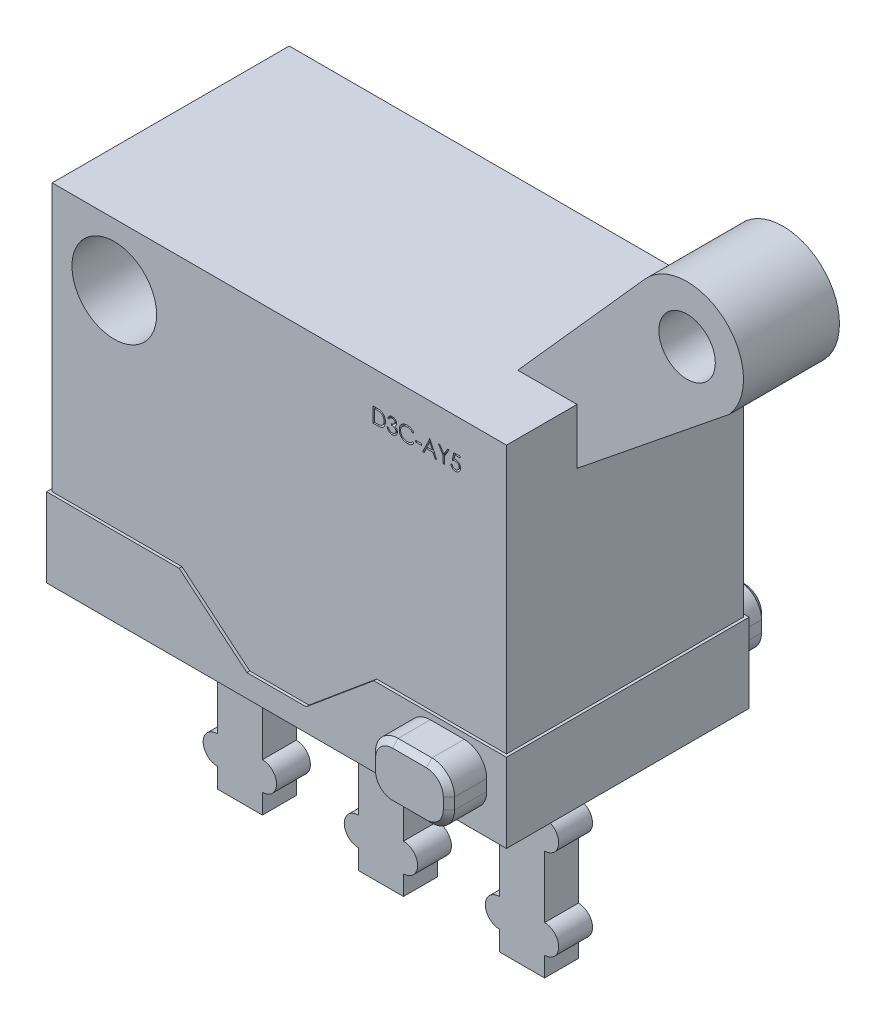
from build123d import *

# Parameters (mm, degrees)
EXTRUDE1_DEPTH      = 4.2
EXTRUDE2_DEPTH      = 0.05
EXTRUDE3_DEPTH      = 0.05
SKETCH5_W           = 4.3
SKETCH5_H           = 1.4
EXTRUDE4_DEPTH      = 0.05
SKETCH6_W           = 4.3
SKETCH6_H           = 1.4
EXTRUDE5_DEPTH      = 0.05
SKETCH10_W          = 1.3
SKETCH10_H          = 0.6
EXTRUDE7_DEPTH      = 3.5
CUT_EXTRUDE3_DEPTH  = 15.422291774
SKETCH12_W          = 0.10176282
SKETCH12_H          = 0.027136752
CUT_EXTRUDE4_DEPTH  = 0.1
SKETCH14_R          = 0.75
CUT_EXTRUDE5_DEPTH  = 15.834503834
CUT_EXTRUDE7_DEPTH  = 10
SKETCH16_R          = 0.5
CUT_EXTRUDE8_DEPTH  = 15.834503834
EXTRUDE8_DEPTH      = 0.67
EXTRUDE9_DEPTH      = 0.67
CHAMFER1_SIZE       = 0.1
CUT_EXTRUDE9_DEPTH  = 1.25
CUT_EXTRUDE10_DEPTH = 1.25


with BuildPart() as part:
    # Sketch1 → Extrude1 (new body)
    with BuildSketch(Plane.XY):
        with BuildLine():
            Line((7, 6.14), (9.253870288, 8.665800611))
            ThreePointArc((9.253870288, 8.665800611), (10.665800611, 8.746129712), (10.746129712, 7.334199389))
            Line((10.746129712, 7.334199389), (8.05, 5.158496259))
            Line((8.05, 5.158496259), (8.05, 0))
            Line((8.05, 0), (7.42, 0))
            Line((7.42, 0), (7.42, 0.35))
            Line((7.42, 0.35), (5.82, 0.35))
            Line((5.82, 0.35), (5.72, 0))
            Line((5.72, 0), (2.33, 0))
            Line((2.33, 0), (2.23, 0.35))
            Line((2.23, 0.35), (0.63, 0.35))
            Line((0.63, 0.35), (0.63, 0))
            Line((0.63, 0), (0, 0))
            Line((0, 0), (0, 6.14))
            Line((0, 6.14), (7, 6.14))
        make_face()
    extrude(amount=-EXTRUDE1_DEPTH)

    # Sketch2 → Extrude2 (add)
    with BuildSketch(Plane.XY):
        Polygon((0, 0), (0, 1.4), (2.3, 1.4), (3.5, 0.4), (4.55, 0.4), (5.75, 1.4), (8.05, 1.4), (8.05, 0), align=None)
    extrude(amount=EXTRUDE2_DEPTH)

    # Sketch3 → Extrude3 (add)
    with BuildSketch(Plane(origin=(0, 0, -4.2), x_dir=(-1, 0, 0), z_dir=(0, 0, -1))):
        Polygon((-8.05, 0), (0, 0), (0, 1.4), (-2.3, 1.4), (-3.5, 0.4), (-4.55, 0.4), (-5.75, 1.4), (-8.05, 1.4), align=None)
    extrude(amount=EXTRUDE3_DEPTH)

    # Sketch5 → Extrude4 (add)
    with BuildSketch(Plane.ZY):
        with Locations((-2.1, 0.7)):
            Rectangle(SKETCH5_W, SKETCH5_H)
    extrude(amount=EXTRUDE4_DEPTH)

    # Sketch6 → Extrude5 (add)
    with BuildSketch(Plane(origin=(8.05, 0, 0), x_dir=(0, 0, -1), z_dir=(1, 0, 0))):
        with Locations((2.1, 0.7)):
            Rectangle(SKETCH6_W, SKETCH6_H)
    extrude(amount=EXTRUDE5_DEPTH)

    # Sketch10 → Extrude7 (add)
    with BuildSketch(Plane.XZ):
        with Locations((1.525, -2.1)):
            Rectangle(SKETCH10_W, SKETCH10_H)
        with Locations((4.025, -2.1)):
            Rectangle(SKETCH10_W, SKETCH10_H)
        with Locations((6.525, -2.1)):
            Rectangle(SKETCH10_W, SKETCH10_H)
    extrude(amount=EXTRUDE7_DEPTH)


with BuildPart() as extrude7_piece_1:
    # of the separate pieces the step leaves, piece 1, a body of its own (extrude7_pieces)
    add(part.part.solids().sort_by_distance((7, 6.14, 0))[0])

    # Sketch11 → Cut-Extrude3 (cut, through all)
    with BuildSketch(Plane.XY.offset(-1.8)):
        with BuildLine():
            Line((1.125, 0), (0.875, 0))
            Line((0.875, 0), (0.875, -1.3))
            ThreePointArc((0.875, -1.3), (0.948223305, -1.123223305), (1.125, -1.05))
            Line((1.125, -1.05), (1.125, 0))
        make_face()
        with BuildLine():
            ThreePointArc((1.125, -1.55), (0.948223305, -1.476776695), (0.875, -1.3))
            Line((0.875, -1.3), (0.875, -2.9))
            ThreePointArc((0.875, -2.9), (0.948223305, -2.723223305), (1.125, -2.65))
            Line((1.125, -2.65), (1.125, -1.55))
        make_face()
        with BuildLine():
            ThreePointArc((1.125, -3.15), (0.948223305, -3.076776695), (0.875, -2.9))
            Line((0.875, -2.9), (0.875, -3.5))
            Line((0.875, -3.5), (1.125, -3.5))
            Line((1.125, -3.5), (1.125, -3.15))
        make_face()
        with BuildLine():
            Line((2.175, 0), (1.925, 0))
            Line((1.925, 0), (1.925, -1.05))
            ThreePointArc((1.925, -1.05), (2.101776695, -1.123223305), (2.175, -1.3))
            Line((2.175, -1.3), (2.175, 0))
        make_face()
        with BuildLine():
            Line((2.175, -2.9), (2.175, -1.3))
            ThreePointArc((2.175, -1.3), (2.101776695, -1.476776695), (1.925, -1.55))
            Line((1.925, -1.55), (1.925, -2.65))
            ThreePointArc((1.925, -2.65), (2.101776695, -2.723223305), (2.175, -2.9))
        make_face()
        with BuildLine():
            Line((2.175, -3.5), (2.175, -2.9))
            ThreePointArc((2.175, -2.9), (2.101776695, -3.076776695), (1.925, -3.15))
            Line((1.925, -3.15), (1.925, -3.5))
            Line((1.925, -3.5), (2.175, -3.5))
        make_face()
        with BuildLine():
            Line((3.625, -1.05), (3.625, 0))
            Line((3.625, 0), (3.375, 0))
            Line((3.375, 0), (3.375, -1.3))
            ThreePointArc((3.375, -1.3), (3.448223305, -1.123223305), (3.625, -1.05))
        make_face()
        with BuildLine():
            ThreePointArc((3.625, -1.55), (3.448223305, -1.476776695), (3.375, -1.3))
            Line((3.375, -1.3), (3.375, -2.9))
            ThreePointArc((3.375, -2.9), (3.448223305, -2.723223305), (3.625, -2.65))
            Line((3.625, -2.65), (3.625, -1.55))
        make_face()
        with BuildLine():
            ThreePointArc((3.625, -3.15), (3.448223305, -3.076776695), (3.375, -2.9))
            Line((3.375, -2.9), (3.375, -3.5))
            Line((3.375, -3.5), (3.625, -3.5))
            Line((3.625, -3.5), (3.625, -3.15))
        make_face()
        with BuildLine():
            Line((4.675, 0), (4.425, 0))
            Line((4.425, 0), (4.425, -1.05))
            ThreePointArc((4.425, -1.05), (4.601776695, -1.123223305), (4.675, -1.3))
            Line((4.675, -1.3), (4.675, 0))
        make_face()
        with BuildLine():
            Line((4.675, -2.9), (4.675, -1.3))
            ThreePointArc((4.675, -1.3), (4.601776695, -1.476776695), (4.425, -1.55))
            Line((4.425, -1.55), (4.425, -2.65))
            ThreePointArc((4.425, -2.65), (4.601776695, -2.723223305), (4.675, -2.9))
        make_face()
        with BuildLine():
            Line((4.675, -3.5), (4.675, -2.9))
            ThreePointArc((4.675, -2.9), (4.601776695, -3.076776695), (4.425, -3.15))
            Line((4.425, -3.15), (4.425, -3.5))
            Line((4.425, -3.5), (4.675, -3.5))
        make_face()
        with BuildLine():
            Line((6.125, 0), (5.875, 0))
            Line((5.875, 0), (5.875, -1.3))
            ThreePointArc((5.875, -1.3), (5.948223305, -1.123223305), (6.125, -1.05))
            Line((6.125, -1.05), (6.125, 0))
        make_face()
        with BuildLine():
            ThreePointArc((6.125, -1.55), (5.948223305, -1.476776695), (5.875, -1.3))
            Line((5.875, -1.3), (5.875, -2.9))
            ThreePointArc((5.875, -2.9), (5.948223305, -2.723223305), (6.125, -2.65))
            Line((6.125, -2.65), (6.125, -1.55))
        make_face()
        with BuildLine():
            ThreePointArc((6.125, -3.15), (5.948223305, -3.076776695), (5.875, -2.9))
            Line((5.875, -2.9), (5.875, -3.5))
            Line((5.875, -3.5), (6.125, -3.5))
            Line((6.125, -3.5), (6.125, -3.15))
        make_face()
        with BuildLine():
            Line((7.175, 0), (6.925, 0))
            Line((6.925, 0), (6.925, -1.05))
            ThreePointArc((6.925, -1.05), (7.101776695, -1.123223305), (7.175, -1.3))
            Line((7.175, -1.3), (7.175, 0))
        make_face()
        with BuildLine():
            Line((7.175, -2.9), (7.175, -1.3))
            ThreePointArc((7.175, -1.3), (7.101776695, -1.476776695), (6.925, -1.55))
            Line((6.925, -1.55), (6.925, -2.65))
            ThreePointArc((6.925, -2.65), (7.101776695, -2.723223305), (7.175, -2.9))
        make_face()
        with BuildLine():
            Line((7.175, -3.5), (7.175, -2.9))
            ThreePointArc((7.175, -2.9), (7.101776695, -3.076776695), (6.925, -3.15))
            Line((6.925, -3.15), (6.925, -3.5))
            Line((6.925, -3.5), (7.175, -3.5))
        make_face()
    extrude(amount=-CUT_EXTRUDE3_DEPTH, mode=Mode.SUBTRACT)

    # Sketch12 → Cut-Extrude4 (cut)
    # profile 1 of 7: a face of its own
    with BuildSketch(Plane(origin=(5.211363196, -0.193911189, 0), x_dir=(1, 0, 0), z_dir=(0, 0, 1))):
        with BuildLine():
            Line((0.477164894, 5.488345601), (0.477164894, 5.752928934))
            Line((0.477164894, 5.752928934), (0.530590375, 5.752928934))
            add(Edge.make_bspline(
                [(0.530590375, 5.752928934), (0.535237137, 5.752895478), (0.544214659, 5.752830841), (0.557187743, 5.75242101), (0.569191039, 5.751696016), (0.580185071, 5.750639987), (0.59020002, 5.749343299), (0.599207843, 5.747717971), (0.607255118, 5.745798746), (0.612204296, 5.744162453), (0.614544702, 5.74338867)],
                knots=[0, 0, 0, 0, 1.314313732, 2.53924729, 3.670748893, 4.714932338, 5.66265055, 6.526160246, 7.303039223, 8, 8, 8, 8], degree=3))
            add(Edge.make_bspline(
                [(0.614544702, 5.74338867), (0.617605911, 5.742222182), (0.623658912, 5.739915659), (0.632277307, 5.735564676), (0.640390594, 5.730634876), (0.648042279, 5.72511976), (0.65505758, 5.71886317), (0.661710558, 5.712130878), (0.667729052, 5.704678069), (0.673240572, 5.696659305), (0.678209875, 5.688169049), (0.682529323, 5.679223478), (0.686116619, 5.669868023), (0.689094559, 5.660128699), (0.691441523, 5.649984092), (0.693042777, 5.639422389), (0.694098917, 5.628485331), (0.694205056, 5.621063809), (0.694258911, 5.617298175)],
                knots=[0, 0, 0, 0, 0.984719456, 1.947108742, 2.898477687, 3.838006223, 4.779231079, 5.722358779, 6.681677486, 7.655904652, 8.64651281, 9.637519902, 10.640069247, 11.656948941, 12.698408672, 13.768548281, 14.867775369, 16, 16, 16, 16], degree=3))
            add(Edge.make_bspline(
                [(0.694258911, 5.617298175), (0.694211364, 5.614027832), (0.694117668, 5.607583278), (0.693276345, 5.598085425), (0.692053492, 5.588869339), (0.69016027, 5.579978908), (0.687861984, 5.571336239), (0.68491648, 5.563033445), (0.681542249, 5.554994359), (0.677607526, 5.547327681), (0.67328791, 5.540064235), (0.668652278, 5.533217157), (0.663705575, 5.526884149), (0.658400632, 5.521046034), (0.652806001, 5.515711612), (0.646885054, 5.510836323), (0.640622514, 5.506515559), (0.63404643, 5.502579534), (0.62696496, 5.499145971), (0.619243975, 5.496240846), (0.610850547, 5.493833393), (0.601805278, 5.49182476), (0.592092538, 5.490231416), (0.581702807, 5.489163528), (0.570652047, 5.488441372), (0.563063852, 5.488378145), (0.559158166, 5.488345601)],
                knots=[0, 0, 0, 0, 1.105936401, 2.179363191, 3.223086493, 4.248585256, 5.251745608, 6.245858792, 7.225916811, 8.198733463, 9.158002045, 10.082870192, 10.993790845, 11.873723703, 12.748670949, 13.606408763, 14.465103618, 15.319838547, 16.196477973, 17.123216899, 18.106603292, 19.147568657, 20.255746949, 21.433717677, 22.679120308, 24, 24, 24, 24], degree=3))
            Line((0.559158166, 5.488345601), (0.477164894, 5.488345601))
        make_face()
        with BuildLine():
            Line((0.500909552, 5.515482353), (0.531279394, 5.515482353))
            add(Edge.make_bspline(
                [(0.531279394, 5.515482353), (0.535643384, 5.515501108), (0.544036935, 5.515537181), (0.556106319, 5.515853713), (0.567134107, 5.516370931), (0.577121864, 5.517094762), (0.58606395, 5.518052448), (0.593979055, 5.519120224), (0.600841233, 5.520450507), (0.604993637, 5.521656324), (0.60691249, 5.52221354)],
                knots=[0, 0, 0, 0, 1.375205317, 2.645023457, 3.804390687, 4.853969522, 5.800190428, 6.637939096, 7.370582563, 8, 8, 8, 8], degree=3))
            add(Edge.make_bspline(
                [(0.60691249, 5.52221354), (0.609327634, 5.523064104), (0.614100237, 5.524744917), (0.620970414, 5.527810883), (0.62737764, 5.531442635), (0.633433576, 5.535479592), (0.639052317, 5.540064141), (0.64430045, 5.545096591), (0.649167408, 5.550602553), (0.653602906, 5.556575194), (0.657572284, 5.562977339), (0.661009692, 5.569746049), (0.664022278, 5.576807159), (0.666386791, 5.584269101), (0.668240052, 5.592065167), (0.66955274, 5.600195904), (0.670370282, 5.608659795), (0.670465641, 5.614416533), (0.670514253, 5.617351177)],
                knots=[0, 0, 0, 0, 0.998632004, 1.973411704, 2.929992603, 3.868527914, 4.809262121, 5.754881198, 6.702106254, 7.672490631, 8.653608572, 9.636854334, 10.631411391, 11.644891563, 12.686317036, 13.754757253, 14.855430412, 16, 16, 16, 16], degree=3))
            add(Edge.make_bspline(
                [(0.670514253, 5.617351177), (0.670475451, 5.620445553), (0.670399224, 5.626524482), (0.669441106, 5.635444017), (0.668040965, 5.644022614), (0.666016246, 5.652260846), (0.663436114, 5.660174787), (0.660216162, 5.667720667), (0.656537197, 5.674978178), (0.652159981, 5.681779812), (0.647366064, 5.688212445), (0.642045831, 5.694105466), (0.636283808, 5.699472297), (0.63014284, 5.704396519), (0.623449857, 5.708680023), (0.616362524, 5.712511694), (0.60877687, 5.715763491), (0.603499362, 5.717493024), (0.600817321, 5.718371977)],
                knots=[0, 0, 0, 0, 1.122418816, 2.205001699, 3.251619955, 4.274784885, 5.280384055, 6.268708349, 7.249350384, 8.229342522, 9.199999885, 10.157847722, 11.105861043, 12.055065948, 13.010012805, 13.98527497, 14.976112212, 16, 16, 16, 16], degree=3))
            add(Edge.make_bspline(
                [(0.600817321, 5.718371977), (0.598598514, 5.71898554), (0.593880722, 5.720290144), (0.586182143, 5.721713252), (0.577517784, 5.722968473), (0.567849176, 5.724031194), (0.55718734, 5.724793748), (0.545524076, 5.725366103), (0.532854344, 5.72575214), (0.524071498, 5.725778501), (0.519513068, 5.725792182)],
                knots=[0, 0, 0, 0, 0.674548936, 1.434276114, 2.292660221, 3.240891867, 4.284742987, 5.42552168, 6.663806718, 8, 8, 8, 8], degree=3))
            Line((0.519513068, 5.725792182), (0.500909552, 5.725792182))
            Line((0.500909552, 5.725792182), (0.500909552, 5.515482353))
        make_face(mode=Mode.SUBTRACT)
    # profile 2 of 7: a face of its own
    with BuildSketch(Plane(origin=(5.211363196, -0.193911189, 0), x_dir=(1, 0, 0), z_dir=(0, 0, 1))):
        with BuildLine():
            Line((0.758708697, 5.691871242), (0.734964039, 5.691871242))
            add(Edge.make_bspline(
                [(0.734964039, 5.691871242), (0.735607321, 5.69453465), (0.736864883, 5.699741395), (0.739487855, 5.707180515), (0.742345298, 5.71422021), (0.745776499, 5.720728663), (0.749519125, 5.726836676), (0.753807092, 5.732405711), (0.758442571, 5.737577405), (0.763569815, 5.742167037), (0.768946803, 5.746323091), (0.774649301, 5.749866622), (0.780562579, 5.752914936), (0.786727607, 5.755426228), (0.793162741, 5.757318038), (0.799809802, 5.758690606), (0.806686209, 5.759581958), (0.811354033, 5.75966895), (0.813724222, 5.759713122)],
                knots=[0, 0, 0, 0, 1.162005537, 2.271625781, 3.343758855, 4.383309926, 5.390229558, 6.379919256, 7.361854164, 8.333198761, 9.295911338, 10.242430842, 11.177959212, 12.116337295, 13.062827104, 14.020064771, 14.994644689, 16, 16, 16, 16], degree=3))
            add(Edge.make_bspline(
                [(0.813724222, 5.759713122), (0.81717762, 5.759608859), (0.824009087, 5.759402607), (0.834045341, 5.757519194), (0.843723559, 5.754538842), (0.852937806, 5.750420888), (0.86149658, 5.745341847), (0.869111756, 5.739296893), (0.875680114, 5.73240266), (0.881190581, 5.724787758), (0.88550518, 5.716649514), (0.888686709, 5.70827355), (0.890623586, 5.699679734), (0.890874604, 5.69387725), (0.891000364, 5.690970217)],
                knots=[0, 0, 0, 0, 1.083050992, 2.142477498, 3.193116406, 4.255571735, 5.30263384, 6.308962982, 7.297363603, 8.282367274, 9.249857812, 10.179914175, 11.08814088, 12, 12, 12, 12], degree=3))
            add(Edge.make_bspline(
                [(0.891000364, 5.690970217), (0.890912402, 5.68817268), (0.890740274, 5.682698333), (0.889278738, 5.674706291), (0.886819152, 5.667173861), (0.883412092, 5.660069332), (0.879001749, 5.653437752), (0.873659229, 5.6472642), (0.867346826, 5.641521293), (0.862563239, 5.638231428), (0.860100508, 5.636537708)],
                knots=[0, 0, 0, 0, 1.024540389, 2.004866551, 2.965041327, 3.920577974, 4.882998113, 5.874504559, 6.905732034, 8, 8, 8, 8], degree=3))
            add(Edge.make_bspline(
                [(0.860100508, 5.636537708), (0.862915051, 5.635178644), (0.868491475, 5.632485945), (0.876092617, 5.627205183), (0.882992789, 5.621107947), (0.886840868, 5.616349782), (0.888774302, 5.613959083)],
                knots=[0, 0, 0, 0, 1.015518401, 2.012035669, 3.001164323, 4, 4, 4, 4], degree=3))
            add(Edge.make_bspline(
                [(0.888774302, 5.613959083), (0.890047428, 5.612216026), (0.89257283, 5.608758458), (0.89569004, 5.603199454), (0.898517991, 5.597578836), (0.900721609, 5.591745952), (0.902428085, 5.585768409), (0.903647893, 5.579635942), (0.90440567, 5.573343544), (0.904514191, 5.569086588), (0.90456874, 5.56694678)],
                knots=[0, 0, 0, 0, 1.025084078, 2.033381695, 3.024893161, 4.013698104, 4.991890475, 5.976764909, 6.982997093, 8, 8, 8, 8], degree=3))
            add(Edge.make_bspline(
                [(0.90456874, 5.56694678), (0.904433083, 5.563241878), (0.904162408, 5.55584951), (0.901743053, 5.544927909), (0.897992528, 5.534251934), (0.892666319, 5.524040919), (0.886175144, 5.514487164), (0.878452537, 5.505939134), (0.869586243, 5.498591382), (0.859697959, 5.492452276), (0.848984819, 5.48754479), (0.837526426, 5.484138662), (0.82548788, 5.481920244), (0.817232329, 5.481682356), (0.813035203, 5.481561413)],
                knots=[0, 0, 0, 0, 0.955779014, 1.907060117, 2.875433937, 3.871313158, 4.872415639, 5.851225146, 6.836215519, 7.83643374, 8.849228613, 9.86973379, 10.916971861, 12, 12, 12, 12], degree=3))
            add(Edge.make_bspline(
                [(0.813035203, 5.481561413), (0.810206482, 5.481627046), (0.804640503, 5.481756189), (0.79645781, 5.482639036), (0.788647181, 5.484251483), (0.781198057, 5.486421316), (0.774103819, 5.489172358), (0.767386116, 5.492598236), (0.761003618, 5.496628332), (0.755016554, 5.501310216), (0.749425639, 5.506547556), (0.744379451, 5.512433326), (0.739793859, 5.518858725), (0.735791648, 5.525898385), (0.732190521, 5.53346133), (0.729228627, 5.541644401), (0.726621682, 5.550374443), (0.725409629, 5.556458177), (0.724787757, 5.559579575)],
                knots=[0, 0, 0, 0, 1.048658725, 2.063410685, 3.046034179, 4.001477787, 4.936774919, 5.862367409, 6.792675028, 7.730719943, 8.675894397, 9.627829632, 10.600096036, 11.597688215, 12.626045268, 13.701542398, 14.82072376, 16, 16, 16, 16], degree=3))
            Line((0.724787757, 5.559579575), (0.748532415, 5.559579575))
            add(Edge.make_bspline(
                [(0.748532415, 5.559579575), (0.749151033, 5.557542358), (0.750354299, 5.553579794), (0.752402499, 5.547876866), (0.754735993, 5.542648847), (0.757239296, 5.537857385), (0.759868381, 5.533455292), (0.762810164, 5.529558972), (0.76584676, 5.525997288), (0.768135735, 5.523990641), (0.76925599, 5.523008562)],
                knots=[0, 0, 0, 0, 1.198163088, 2.33053128, 3.407730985, 4.417276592, 5.372219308, 6.28897303, 7.162600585, 8, 8, 8, 8], degree=3))
            add(Edge.make_bspline(
                [(0.76925599, 5.523008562), (0.770737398, 5.521866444), (0.77369564, 5.519585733), (0.778516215, 5.516675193), (0.783586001, 5.514153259), (0.789014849, 5.512226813), (0.794685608, 5.510595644), (0.800689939, 5.5095282), (0.806974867, 5.508795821), (0.81126624, 5.508731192), (0.813459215, 5.508698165)],
                knots=[0, 0, 0, 0, 0.946170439, 1.889420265, 2.845303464, 3.807233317, 4.801018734, 5.828864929, 6.890507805, 8, 8, 8, 8], degree=3))
            add(Edge.make_bspline(
                [(0.813459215, 5.508698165), (0.815935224, 5.508744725), (0.820776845, 5.508835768), (0.827841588, 5.509673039), (0.834562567, 5.510892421), (0.840865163, 5.512775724), (0.846831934, 5.51510261), (0.852379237, 5.518024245), (0.857579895, 5.52145209), (0.862367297, 5.525348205), (0.866672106, 5.529613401), (0.870462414, 5.534074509), (0.873684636, 5.538712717), (0.87628387, 5.543553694), (0.878336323, 5.548577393), (0.879733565, 5.553797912), (0.880705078, 5.559172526), (0.880784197, 5.562825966), (0.880824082, 5.564667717)],
                knots=[0, 0, 0, 0, 1.217147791, 2.380027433, 3.494444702, 4.572153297, 5.609568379, 6.639424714, 7.649109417, 8.668170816, 9.669597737, 10.625200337, 11.543417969, 12.441394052, 13.322311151, 14.205496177, 15.095365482, 16, 16, 16, 16], degree=3))
            add(Edge.make_bspline(
                [(0.880824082, 5.564667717), (0.880708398, 5.567132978), (0.880477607, 5.572051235), (0.878715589, 5.579287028), (0.875817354, 5.586258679), (0.871759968, 5.592847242), (0.866820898, 5.598953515), (0.861048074, 5.604401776), (0.854393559, 5.608897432), (0.848268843, 5.612003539), (0.842843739, 5.614123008), (0.838201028, 5.615534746), (0.833003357, 5.616730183), (0.827313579, 5.617842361), (0.821088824, 5.618788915), (0.814335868, 5.619578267), (0.807053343, 5.620209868), (0.802011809, 5.620491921), (0.799413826, 5.620637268)],
                knots=[0, 0, 0, 0, 1.07054697, 2.135767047, 3.216561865, 4.33974944, 5.486079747, 6.621378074, 7.775625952, 8.963672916, 9.598146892, 10.304877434, 11.070270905, 11.915000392, 12.823868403, 13.805723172, 14.86925407, 16, 16, 16, 16], degree=3))
            Line((0.799413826, 5.620637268), (0.799413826, 5.64777402))
            add(Edge.make_bspline(
                [(0.799413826, 5.64777402), (0.802687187, 5.647829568), (0.809098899, 5.647938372), (0.818464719, 5.649254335), (0.827420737, 5.651074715), (0.835768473, 5.65386306), (0.843377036, 5.657101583), (0.849977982, 5.660870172), (0.855478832, 5.665059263), (0.859852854, 5.669733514), (0.863143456, 5.674746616), (0.865549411, 5.679971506), (0.866970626, 5.68545398), (0.867160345, 5.689195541), (0.867255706, 5.69107622)],
                knots=[0, 0, 0, 0, 1.321986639, 2.589447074, 3.816329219, 5.01088745, 6.139805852, 7.153945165, 8.075214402, 8.924034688, 9.728124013, 10.488707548, 11.240355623, 12, 12, 12, 12], degree=3))
            add(Edge.make_bspline(
                [(0.867255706, 5.69107622), (0.867224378, 5.692457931), (0.867162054, 5.695206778), (0.866376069, 5.69922278), (0.865194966, 5.703116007), (0.863571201, 5.706869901), (0.861397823, 5.710458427), (0.858796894, 5.713912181), (0.855699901, 5.717211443), (0.852151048, 5.720286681), (0.848340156, 5.723217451), (0.844163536, 5.725705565), (0.839747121, 5.727833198), (0.83508602, 5.729587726), (0.830165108, 5.730907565), (0.825007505, 5.731855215), (0.819603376, 5.732447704), (0.815916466, 5.732533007), (0.814042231, 5.73257637)],
                knots=[0, 0, 0, 0, 0.884392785, 1.759457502, 2.611959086, 3.489218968, 4.37281399, 5.2945488, 6.255912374, 7.266815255, 8.301784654, 9.332968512, 10.37626691, 11.440494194, 12.520033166, 13.637162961, 14.798855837, 16, 16, 16, 16], degree=3))
            add(Edge.make_bspline(
                [(0.814042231, 5.73257637), (0.811029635, 5.73247119), (0.805145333, 5.732265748), (0.79666242, 5.730466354), (0.788776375, 5.727595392), (0.782748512, 5.724168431), (0.778297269, 5.720785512), (0.775116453, 5.717831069), (0.771992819, 5.714547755), (0.769131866, 5.710733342), (0.766238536, 5.70664615), (0.763604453, 5.702078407), (0.761044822, 5.697149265), (0.759502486, 5.693664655), (0.758708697, 5.691871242)],
                knots=[0, 0, 0, 0, 1.472543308, 2.876219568, 4.221790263, 5.565193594, 6.249813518, 6.953379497, 7.687249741, 8.463570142, 9.283606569, 10.136032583, 11.040678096, 12, 12, 12, 12], degree=3))
        make_face()
    # profile 3 of 7: a face of its own
    with BuildSketch(Plane(origin=(5.211363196, -0.193911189, 0), x_dir=(1, 0, 0), z_dir=(0, 0, 1))):
        with BuildLine():
            Line((1.196288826, 5.704379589), (1.17551225, 5.688479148))
            add(Edge.make_bspline(
                [(1.17551225, 5.688479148), (1.174030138, 5.690245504), (1.171085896, 5.693754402), (1.166349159, 5.698681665), (1.161412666, 5.703297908), (1.156278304, 5.707625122), (1.150853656, 5.711511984), (1.145270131, 5.71516105), (1.139434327, 5.718431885), (1.131364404, 5.722397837), (1.120807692, 5.726536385), (1.107518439, 5.730006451), (1.093645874, 5.732215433), (1.084181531, 5.73245468), (1.079367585, 5.73257637)],
                knots=[0, 0, 0, 0, 0.757959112, 1.505699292, 2.245454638, 2.979532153, 3.711538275, 4.438200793, 5.171680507, 5.909471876, 7.393775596, 8.890124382, 10.418191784, 12, 12, 12, 12], degree=3))
            add(Edge.make_bspline(
                [(1.079367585, 5.73257637), (1.076715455, 5.732545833), (1.071435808, 5.732485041), (1.063600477, 5.731683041), (1.055911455, 5.730555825), (1.048373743, 5.728883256), (1.040996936, 5.726768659), (1.033732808, 5.724241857), (1.02668653, 5.721115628), (1.019760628, 5.717660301), (1.013124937, 5.713757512), (1.006846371, 5.709500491), (1.000947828, 5.704936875), (0.995424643, 5.700049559), (0.990271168, 5.694860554), (0.985524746, 5.689314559), (0.981201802, 5.683429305), (0.977216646, 5.677282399), (0.973647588, 5.670891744), (0.970659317, 5.664233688), (0.968013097, 5.657422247), (0.965919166, 5.650380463), (0.964261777, 5.643157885), (0.963118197, 5.635735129), (0.962325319, 5.628127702), (0.962264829, 5.622971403), (0.962234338, 5.62037226)],
                knots=[0, 0, 0, 0, 1.054917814, 2.100044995, 3.131103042, 4.146048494, 5.169673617, 6.183595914, 7.203665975, 8.234915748, 9.262203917, 10.264457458, 11.251630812, 12.227803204, 13.197192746, 14.159520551, 15.12972552, 16.100847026, 17.073214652, 18.039054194, 19.002613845, 19.979014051, 20.95965708, 21.949030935, 22.966165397, 24, 24, 24, 24], degree=3))
            add(Edge.make_bspline(
                [(0.962234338, 5.62037226), (0.962329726, 5.616461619), (0.962517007, 5.608783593), (0.964183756, 5.597537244), (0.966716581, 5.586763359), (0.970512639, 5.576529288), (0.975193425, 5.566708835), (0.981108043, 5.557468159), (0.987958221, 5.548667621), (0.995840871, 5.540515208), (1.004489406, 5.53306804), (1.013768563, 5.526510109), (1.023655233, 5.521043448), (1.034040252, 5.516494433), (1.045003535, 5.512997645), (1.056525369, 5.510535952), (1.068580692, 5.508930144), (1.07681826, 5.508776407), (1.08101063, 5.508698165)],
                knots=[0, 0, 0, 0, 1.029171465, 2.020641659, 2.987623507, 3.938342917, 4.889210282, 5.84687017, 6.821220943, 7.821438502, 8.827599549, 9.822697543, 10.807740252, 11.797342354, 12.80366471, 13.83203677, 14.896651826, 16, 16, 16, 16], degree=3))
            add(Edge.make_bspline(
                [(1.08101063, 5.508698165), (1.085629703, 5.508825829), (1.094721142, 5.509077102), (1.108053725, 5.511205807), (1.120816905, 5.514657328), (1.133011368, 5.519487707), (1.144602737, 5.525767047), (1.155609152, 5.533379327), (1.166039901, 5.542396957), (1.172312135, 5.549282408), (1.17551225, 5.552795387)],
                knots=[0, 0, 0, 0, 1.028121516, 2.023589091, 2.998037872, 3.967518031, 4.937445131, 5.927275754, 6.942489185, 8, 8, 8, 8], degree=3))
            Line((1.17551225, 5.552795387), (1.196288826, 5.537053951))
            add(Edge.make_bspline(
                [(1.196288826, 5.537053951), (1.194616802, 5.53489658), (1.191280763, 5.530592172), (1.185878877, 5.524524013), (1.180188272, 5.518816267), (1.17416668, 5.513514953), (1.16788337, 5.50851399), (1.161225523, 5.503955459), (1.154280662, 5.499775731), (1.147072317, 5.495948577), (1.139608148, 5.492553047), (1.131897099, 5.489646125), (1.123972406, 5.487142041), (1.115833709, 5.485081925), (1.107464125, 5.483473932), (1.098893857, 5.482398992), (1.090104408, 5.48166255), (1.08417461, 5.481595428), (1.081169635, 5.481561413)],
                knots=[0, 0, 0, 0, 0.986787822, 1.968848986, 2.935600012, 3.899624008, 4.868462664, 5.837806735, 6.815139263, 7.798259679, 8.787526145, 9.778297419, 10.776456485, 11.791383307, 12.812564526, 13.85620153, 14.913611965, 16, 16, 16, 16], degree=3))
            add(Edge.make_bspline(
                [(1.081169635, 5.481561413), (1.078323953, 5.481581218), (1.072696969, 5.481620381), (1.064389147, 5.482254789), (1.056301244, 5.483120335), (1.048456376, 5.484423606), (1.040811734, 5.485961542), (1.033436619, 5.488023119), (1.026258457, 5.49033249), (1.019306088, 5.493046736), (1.012573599, 5.496109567), (1.006082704, 5.499571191), (0.999836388, 5.503402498), (0.99377324, 5.507519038), (0.987982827, 5.512053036), (0.982414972, 5.516941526), (0.977038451, 5.52216803), (0.973712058, 5.52593682), (0.97203961, 5.527831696)],
                knots=[0, 0, 0, 0, 1.114604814, 2.203992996, 3.262667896, 4.300477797, 5.318619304, 6.316056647, 7.298880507, 8.271930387, 9.238335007, 10.195173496, 11.151986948, 12.108099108, 13.064862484, 14.031167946, 15.010108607, 16, 16, 16, 16], degree=3))
            add(Edge.make_bspline(
                [(0.97203961, 5.527831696), (0.969360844, 5.531123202), (0.964035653, 5.537666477), (0.95722258, 5.548271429), (0.951390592, 5.559343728), (0.94667527, 5.570941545), (0.942989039, 5.583038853), (0.940435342, 5.595641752), (0.938775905, 5.608738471), (0.938586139, 5.617646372), (0.93848968, 5.62217431)],
                knots=[0, 0, 0, 0, 0.994628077, 1.977248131, 2.950237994, 3.925870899, 4.908910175, 5.911660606, 6.938484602, 8, 8, 8, 8], degree=3))
            add(Edge.make_bspline(
                [(0.93848968, 5.62217431), (0.938607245, 5.626933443), (0.938838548, 5.636296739), (0.940803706, 5.650037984), (0.943965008, 5.663203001), (0.94845513, 5.675767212), (0.954147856, 5.687796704), (0.961180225, 5.699199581), (0.969470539, 5.710048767), (0.978953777, 5.720179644), (0.989353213, 5.729443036), (1.000489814, 5.737592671), (1.012341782, 5.744374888), (1.024778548, 5.750044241), (1.03789324, 5.754401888), (1.051657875, 5.757452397), (1.066046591, 5.759351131), (1.075863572, 5.759591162), (1.080851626, 5.759713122)],
                knots=[0, 0, 0, 0, 1.032925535, 2.032216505, 3.007276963, 3.968222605, 4.92396291, 5.891752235, 6.871517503, 7.883894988, 8.900124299, 9.891468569, 10.874487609, 11.85992873, 12.854644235, 13.869047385, 14.917252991, 16, 16, 16, 16], degree=3))
            add(Edge.make_bspline(
                [(1.080851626, 5.759713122), (1.083891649, 5.759676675), (1.089909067, 5.759604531), (1.098810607, 5.758901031), (1.107477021, 5.757728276), (1.11591428, 5.756132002), (1.12416343, 5.754150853), (1.132161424, 5.751570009), (1.139955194, 5.748619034), (1.147495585, 5.745220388), (1.15474642, 5.741405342), (1.161705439, 5.737216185), (1.168317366, 5.732658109), (1.174628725, 5.727769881), (1.180533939, 5.722448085), (1.18620067, 5.7168391), (1.191436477, 5.710781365), (1.194668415, 5.70651742), (1.196288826, 5.704379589)],
                knots=[0, 0, 0, 0, 1.096760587, 2.17092713, 3.219439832, 4.250915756, 5.268269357, 6.278326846, 7.281116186, 8.274029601, 9.260640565, 10.235837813, 11.203064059, 12.156899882, 13.114053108, 14.069676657, 15.032185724, 16, 16, 16, 16], degree=3))
        make_face()
    # profile 4 of 7: a face of its own
    with BuildSketch(Plane(origin=(5.211363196, -0.193911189, 0), x_dir=(1, 0, 0), z_dir=(0, 0, 1))):
        with Locations((1.277699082, 5.590108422)):
            Rectangle(SKETCH12_W, SKETCH12_H)
    # profile 5 of 7: a face of its own
    with BuildSketch(Plane(origin=(5.211363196, -0.193911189, 0), x_dir=(1, 0, 0), z_dir=(0, 0, 1))):
        Polygon((1.481224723, 5.752928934), (1.603340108, 5.488345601), (1.577528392, 5.488345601), (1.538413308, 5.573147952), (1.418470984, 5.573147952), (1.378242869, 5.488345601), (1.35232515, 5.488345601), (1.477832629, 5.752928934), align=None)
        Polygon((1.479263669, 5.701358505), (1.431350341, 5.600284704), (1.525904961, 5.600284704), align=None, mode=Mode.SUBTRACT)
    # profile 6 of 7: a face of its own
    with BuildSketch(Plane(origin=(5.211363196, -0.193911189, 0), x_dir=(1, 0, 0), z_dir=(0, 0, 1))):
        Polygon((1.63047686, 5.752928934), (1.657666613, 5.752928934), (1.727204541, 5.639240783), (1.796636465, 5.752928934), (1.823826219, 5.752928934), (1.739023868, 5.614118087), (1.739023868, 5.488345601), (1.71527921, 5.488345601), (1.71527921, 5.614118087), align=None)
    # profile 7 of 7: a face of its own
    with BuildSketch(Plane(origin=(5.211363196, -0.193911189, 0), x_dir=(1, 0, 0), z_dir=(0, 0, 1))):
        with BuildLine():
            Line((2.013783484, 5.752928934), (2.013783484, 5.725792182))
            Line((2.013783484, 5.725792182), (1.923786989, 5.725792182))
            Line((1.923786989, 5.725792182), (1.909529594, 5.656201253))
            add(Edge.make_bspline(
                [(1.909529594, 5.656201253), (1.912330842, 5.656974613), (1.917757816, 5.658472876), (1.925767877, 5.660136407), (1.933372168, 5.661139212), (1.938306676, 5.661276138), (1.940694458, 5.661342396)],
                knots=[0, 0, 0, 0, 1.100273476, 2.13160584, 3.095893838, 4, 4, 4, 4], degree=3))
            add(Edge.make_bspline(
                [(1.940694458, 5.661342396), (1.943649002, 5.661278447), (1.949458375, 5.661152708), (1.957958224, 5.659945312), (1.96607208, 5.658044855), (1.973782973, 5.65538991), (1.98110517, 5.651994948), (1.987971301, 5.64775406), (1.994484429, 5.642800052), (2.000527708, 5.637104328), (2.006010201, 5.630835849), (2.010830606, 5.624095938), (2.01492504, 5.616950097), (2.018218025, 5.609330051), (2.020847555, 5.601320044), (2.022597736, 5.592835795), (2.023763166, 5.583957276), (2.02389337, 5.577886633), (2.023959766, 5.574790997)],
                knots=[0, 0, 0, 0, 1.052922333, 2.070308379, 3.05430497, 4.020497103, 4.973039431, 5.925935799, 6.892292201, 7.88610001, 8.88166317, 9.857072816, 10.836096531, 11.812156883, 12.81219415, 13.836441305, 14.89672472, 16, 16, 16, 16], degree=3))
            add(Edge.make_bspline(
                [(2.023959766, 5.574790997), (2.023909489, 5.572634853), (2.023809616, 5.568351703), (2.023301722, 5.561990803), (2.022323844, 5.555764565), (2.021010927, 5.549672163), (2.019306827, 5.543725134), (2.017243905, 5.537906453), (2.014719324, 5.532252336), (2.011950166, 5.526709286), (2.008832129, 5.521402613), (2.005371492, 5.516439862), (2.001715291, 5.511746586), (1.99778121, 5.507373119), (1.993532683, 5.503348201), (1.989021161, 5.499647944), (1.984282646, 5.496209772), (1.979243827, 5.493173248), (1.974016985, 5.490379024), (1.968526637, 5.488086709), (1.962897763, 5.486037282), (1.957049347, 5.484403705), (1.950994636, 5.483123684), (1.94472365, 5.482254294), (1.938269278, 5.481621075), (1.933894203, 5.481581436), (1.931684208, 5.481561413)],
                knots=[0, 0, 0, 0, 1.056347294, 2.098418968, 3.122841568, 4.141288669, 5.149314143, 6.15115421, 7.162517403, 8.180376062, 9.185164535, 10.17417709, 11.141909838, 12.097768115, 13.052685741, 14.0056014, 14.954263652, 15.917497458, 16.885230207, 17.854509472, 18.828990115, 19.81800267, 20.826176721, 21.857883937, 22.917946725, 24, 24, 24, 24], degree=3))
            add(Edge.make_bspline(
                [(1.931684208, 5.481561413), (1.929047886, 5.481613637), (1.923861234, 5.481716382), (1.916262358, 5.482791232), (1.908951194, 5.484330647), (1.901986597, 5.486646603), (1.895306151, 5.4895485), (1.88899979, 5.493216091), (1.882906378, 5.497372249), (1.877273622, 5.502276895), (1.872045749, 5.507637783), (1.867365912, 5.513455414), (1.863198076, 5.519633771), (1.859608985, 5.526202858), (1.856547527, 5.533145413), (1.854142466, 5.54048745), (1.852201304, 5.548190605), (1.851380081, 5.553493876), (1.850962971, 5.556187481)],
                knots=[0, 0, 0, 0, 1.0467383, 2.05933395, 3.04377827, 4.011590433, 4.970194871, 5.932262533, 6.905835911, 7.896367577, 8.894135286, 9.877477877, 10.858688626, 11.851381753, 12.8477658, 13.868841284, 14.917554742, 16, 16, 16, 16], degree=3))
            Line((1.850962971, 5.556187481), (1.874707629, 5.556187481))
            add(Edge.make_bspline(
                [(1.874707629, 5.556187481), (1.875291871, 5.553664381), (1.876414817, 5.548814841), (1.878879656, 5.54200134), (1.881893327, 5.53592959), (1.88547687, 5.53051927), (1.889751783, 5.525801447), (1.8946299, 5.521597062), (1.900099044, 5.517804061), (1.906176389, 5.514642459), (1.912587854, 5.511946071), (1.919298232, 5.510150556), (1.926124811, 5.508888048), (1.930742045, 5.508761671), (1.933062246, 5.508698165)],
                knots=[0, 0, 0, 0, 1.136247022, 2.183929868, 3.172523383, 4.106158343, 5.02341133, 5.958108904, 6.928429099, 7.938127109, 8.96079061, 9.975095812, 10.982467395, 12, 12, 12, 12], degree=3))
            add(Edge.make_bspline(
                [(1.933062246, 5.508698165), (1.935326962, 5.508760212), (1.939786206, 5.508882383), (1.946348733, 5.509822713), (1.952684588, 5.511270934), (1.958731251, 5.513438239), (1.964594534, 5.516072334), (1.970126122, 5.51945258), (1.975486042, 5.523342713), (1.980507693, 5.527799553), (1.985106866, 5.532710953), (1.989170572, 5.537963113), (1.992555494, 5.543565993), (1.995408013, 5.549422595), (1.997574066, 5.555597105), (1.999119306, 5.562060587), (2.000026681, 5.568829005), (2.000151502, 5.573445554), (2.000215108, 5.575798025)],
                knots=[0, 0, 0, 0, 1.027316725, 2.022795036, 3.002884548, 3.971462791, 4.93288096, 5.914575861, 6.907176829, 7.935150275, 8.956128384, 9.956726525, 10.942570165, 11.921478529, 12.907843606, 13.90538589, 14.932640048, 16, 16, 16, 16], degree=3))
            add(Edge.make_bspline(
                [(2.000215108, 5.575798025), (2.00016533, 5.577920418), (2.000067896, 5.582074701), (1.999271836, 5.588152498), (1.99788716, 5.593903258), (1.995965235, 5.59935475), (1.993525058, 5.604512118), (1.990543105, 5.609380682), (1.986963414, 5.613896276), (1.982874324, 5.61806101), (1.978394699, 5.621904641), (1.973447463, 5.625181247), (1.968136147, 5.627937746), (1.962524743, 5.630316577), (1.956479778, 5.632025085), (1.950120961, 5.633307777), (1.943379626, 5.634049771), (1.938770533, 5.634152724), (1.936401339, 5.634205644)],
                knots=[0, 0, 0, 0, 1.045622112, 2.046656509, 3.013763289, 3.955457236, 4.890082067, 5.820317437, 6.762574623, 7.722996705, 8.69280354, 9.665887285, 10.63943826, 11.638615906, 12.663482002, 13.728887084, 14.832589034, 16, 16, 16, 16], degree=3))
            add(Edge.make_bspline(
                [(1.936401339, 5.634205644), (1.934350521, 5.634161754), (1.930116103, 5.634071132), (1.923620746, 5.633403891), (1.916795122, 5.632327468), (1.909665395, 5.630846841), (1.902210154, 5.628909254), (1.894445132, 5.626587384), (1.886354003, 5.623811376), (1.880902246, 5.621714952), (1.878099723, 5.620637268)],
                knots=[0, 0, 0, 0, 0.817624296, 1.688186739, 2.600797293, 3.572016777, 4.590301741, 5.671205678, 6.80286297, 8, 8, 8, 8], degree=3))
            Line((1.878099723, 5.620637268), (1.905236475, 5.752928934))
            Line((1.905236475, 5.752928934), (2.013783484, 5.752928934))
        make_face()
    extrude(amount=-CUT_EXTRUDE4_DEPTH, mode=Mode.SUBTRACT)

    # Sketch14 → Cut-Extrude5 (cut, through all)
    with BuildSketch(Plane.XY):
        with Locations((1.1, 5.04)):
            Circle(SKETCH14_R)
    extrude(amount=-CUT_EXTRUDE5_DEPTH, mode=Mode.SUBTRACT)

    # Sketch16 → Cut-Extrude8 (cut, through all)
    with BuildSketch(Plane.XY):
        with Locations((10, 8)):
            Circle(SKETCH16_R)
    extrude(amount=-CUT_EXTRUDE8_DEPTH, mode=Mode.SUBTRACT)

    # Sketch17 → Extrude8 (add)
    with BuildSketch(Plane.XY.offset(0.05)):
        with BuildLine():
            Line((6.75, 1.3), (7.35, 1.3))
            ThreePointArc((7.35, 1.3), (7.632842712, 1.182842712), (7.75, 0.9))
            Line((7.75, 0.9), (7.75, 0.7))
            ThreePointArc((7.75, 0.7), (7.632842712, 0.417157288), (7.35, 0.3))
            Line((7.35, 0.3), (6.75, 0.3))
            ThreePointArc((6.75, 0.3), (6.467157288, 0.417157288), (6.35, 0.7))
            Line((6.35, 0.7), (6.35, 0.9))
            ThreePointArc((6.35, 0.9), (6.467157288, 1.182842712), (6.75, 1.3))
        make_face()
    extrude(amount=EXTRUDE8_DEPTH)

    # Sketch18 → Extrude9 (add)
    with BuildSketch(Plane(origin=(0, 0, -4.25), x_dir=(-1, 0, 0), z_dir=(0, 0, -1))):
        with BuildLine():
            Line((-7.75, 0.9), (-7.75, 0.7))
            ThreePointArc((-7.75, 0.7), (-7.632842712, 0.417157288), (-7.35, 0.3))
            Line((-7.35, 0.3), (-6.75, 0.3))
            ThreePointArc((-6.75, 0.3), (-6.467157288, 0.417157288), (-6.35, 0.7))
            Line((-6.35, 0.7), (-6.35, 0.9))
            ThreePointArc((-6.35, 0.9), (-6.467157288, 1.182842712), (-6.75, 1.3))
            Line((-6.75, 1.3), (-7.35, 1.3))
            ThreePointArc((-7.35, 1.3), (-7.632842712, 1.182842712), (-7.75, 0.9))
        make_face()
    extrude(amount=EXTRUDE9_DEPTH)

    # Chamfer1
    chamfer1_edges = [extrude7_piece_1.edges().sort_by_distance(p)[0] for p in [
        (7.632842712, 0.417157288, 0.72),
        (7.75, 0.8, 0.72),
        (7.632842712, 1.182842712, 0.72),
        (7.05, 1.3, 0.72),
        (6.467157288, 1.182842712, 0.72),
        (6.35, 0.8, 0.72),
        (6.467157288, 0.417157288, 0.72),
        (7.05, 0.3, 0.72),
        (7.632842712, 0.417157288, -4.92),
        (7.05, 0.3, -4.92),
        (6.467157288, 0.417157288, -4.92),
        (6.35, 0.8, -4.92),
        (6.467157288, 1.182842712, -4.92),
        (7.05, 1.3, -4.92),
        (7.632842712, 1.182842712, -4.92),
        (7.75, 0.8, -4.92),
    ]]
    chamfer(chamfer1_edges, length=CHAMFER1_SIZE)

    # Sketch19 → Cut-Extrude9 (cut)
    with BuildSketch(Plane(origin=(0, 0, -4.2), x_dir=(-1, 0, 0), z_dir=(0, 0, -1))):
        with BuildLine():
            Line((-9.253870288, 8.665800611), (-7, 6.14))
            Line((-7, 6.14), (-8.05, 6.14))
            Line((-8.05, 6.14), (-8.05, 5.158496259))
            Line((-8.05, 5.158496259), (-10.493166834, 7.130065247))
            ThreePointArc((-10.493166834, 7.130065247), (-10.778214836, 8.627998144), (-9.253870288, 8.665800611))
        make_face()
    extrude(amount=-CUT_EXTRUDE9_DEPTH, mode=Mode.SUBTRACT)

    # Sketch20 → Cut-Extrude10 (cut)
    with BuildSketch(Plane.XY):
        with BuildLine():
            Line((9.253870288, 8.665800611), (7, 6.14))
            Line((7, 6.14), (8.05, 6.14))
            Line((8.05, 6.14), (8.05, 5.158496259))
            Line((8.05, 5.158496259), (10.493166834, 7.130065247))
            ThreePointArc((10.493166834, 7.130065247), (10.778214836, 8.627998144), (9.253870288, 8.665800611))
        make_face()
    extrude(amount=-CUT_EXTRUDE10_DEPTH, mode=Mode.SUBTRACT)


with BuildPart() as extrude7_piece_2:
    # of the separate pieces the step leaves, piece 2, a body of its own (extrude7_pieces)
    add(part.part.solids().sort_by_distance((0.875, 0, -1.8))[0])


with BuildPart() as extrude7_piece_3:
    # of the separate pieces the step leaves, piece 3, a body of its own (extrude7_pieces)
    add(part.part.solids().sort_by_distance((5.875, 0, -1.8))[0])


with BuildPart() as cut_extrude7_tool:
    # Sketch15 → Cut-Extrude7 (new body)
    with BuildSketch(Plane(origin=(2.118420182, -2.831159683, -1.8), x_dir=(1, 0, 0), z_dir=(0, 0, 1))):
        with BuildLine():
            Line((4.006579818, -0.668840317), (4.006579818, -0.318840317))
            ThreePointArc((4.006579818, -0.318840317), (3.829803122, -0.245617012), (3.756579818, -0.068840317))
            Line((3.756579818, -0.068840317), (3.756579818, -0.668840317))
            Line((3.756579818, -0.668840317), (4.006579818, -0.668840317))
        make_face()
        with BuildLine():
            Line((3.756579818, 1.531159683), (3.756579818, -0.068840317))
            ThreePointArc((3.756579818, -0.068840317), (3.829803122, 0.107936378), (4.006579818, 0.181159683))
            Line((4.006579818, 0.181159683), (4.006579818, 1.281159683))
            ThreePointArc((4.006579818, 1.281159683), (3.829803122, 1.354382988), (3.756579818, 1.531159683))
        make_face()
        with BuildLine():
            Line((3.756579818, 2.831159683), (3.756579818, 1.531159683))
            ThreePointArc((3.756579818, 1.531159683), (3.829803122, 1.707936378), (4.006579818, 1.781159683))
            Line((4.006579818, 1.781159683), (4.006579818, 2.831159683))
            Line((4.006579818, 2.831159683), (3.756579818, 2.831159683))
        make_face()
        with BuildLine():
            Line((5.056579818, 2.831159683), (4.806579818, 2.831159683))
            Line((4.806579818, 2.831159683), (4.806579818, 1.781159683))
            ThreePointArc((4.806579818, 1.781159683), (4.983356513, 1.707936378), (5.056579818, 1.531159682))
            Line((5.056579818, 1.531159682), (5.056579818, 2.831159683))
        make_face()
        with BuildLine():
            Line((5.056579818, -0.068840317), (5.056579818, 1.531159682))
            ThreePointArc((5.056579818, 1.531159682), (4.983356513, 1.354382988), (4.806579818, 1.281159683))
            Line((4.806579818, 1.281159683), (4.806579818, 0.181159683))
            ThreePointArc((4.806579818, 0.181159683), (4.983356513, 0.107936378), (5.056579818, -0.068840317))
        make_face()
        with BuildLine():
            Line((5.056579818, -0.668840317), (5.056579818, -0.068840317))
            ThreePointArc((5.056579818, -0.068840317), (4.983356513, -0.245617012), (4.806579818, -0.318840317))
            Line((4.806579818, -0.318840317), (4.806579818, -0.668840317))
            Line((4.806579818, -0.668840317), (5.056579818, -0.668840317))
        make_face()
        with BuildLine():
            ThreePointArc((-0.993420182, -0.318840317), (-1.170196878, -0.245617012), (-1.243420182, -0.068840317))
            Line((-1.243420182, -0.068840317), (-1.243420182, -0.668840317))
            Line((-1.243420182, -0.668840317), (-0.993420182, -0.668840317))
            Line((-0.993420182, -0.668840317), (-0.993420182, -0.318840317))
        make_face()
        with BuildLine():
            ThreePointArc((-0.993420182, 1.281159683), (-1.170196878, 1.354382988), (-1.243420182, 1.531159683))
            Line((-1.243420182, 1.531159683), (-1.243420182, -0.068840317))
            ThreePointArc((-1.243420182, -0.068840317), (-1.170196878, 0.107936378), (-0.993420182, 0.181159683))
            Line((-0.993420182, 0.181159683), (-0.993420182, 1.281159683))
        make_face()
        with BuildLine():
            Line((-0.993420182, 1.781159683), (-0.993420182, 2.831159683))
            Line((-0.993420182, 2.831159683), (-1.243420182, 2.831159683))
            Line((-1.243420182, 2.831159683), (-1.243420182, 1.531159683))
            ThreePointArc((-1.243420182, 1.531159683), (-1.170196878, 1.707936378), (-0.993420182, 1.781159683))
        make_face()
        with BuildLine():
            Line((0.056579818, 2.831159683), (-0.193420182, 2.831159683))
            Line((-0.193420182, 2.831159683), (-0.193420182, 1.781159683))
            ThreePointArc((-0.193420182, 1.781159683), (-0.016643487, 1.707936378), (0.056579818, 1.531159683))
            Line((0.056579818, 1.531159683), (0.056579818, 2.831159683))
        make_face()
        with BuildLine():
            Line((0.056579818, -0.068840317), (0.056579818, 1.531159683))
            ThreePointArc((0.056579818, 1.531159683), (-0.016643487, 1.354382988), (-0.193420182, 1.281159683))
            Line((-0.193420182, 1.281159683), (-0.193420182, 0.181159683))
            ThreePointArc((-0.193420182, 0.181159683), (-0.016643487, 0.107936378), (0.056579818, -0.068840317))
        make_face()
        with BuildLine():
            Line((0.056579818, -0.668840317), (0.056579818, -0.068840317))
            ThreePointArc((0.056579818, -0.068840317), (-0.016643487, -0.245617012), (-0.193420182, -0.318840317))
            Line((-0.193420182, -0.318840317), (-0.193420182, -0.668840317))
            Line((-0.193420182, -0.668840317), (0.056579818, -0.668840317))
        make_face()
    extrude(amount=-CUT_EXTRUDE7_DEPTH)


with BuildPart() as extrude7_piece_2_1:
    add(extrude7_piece_2.part)

    # Cut-Extrude7: cut by cut_extrude7_tool
    add(cut_extrude7_tool.part, mode=Mode.SUBTRACT)


with BuildPart() as extrude7_piece_3_1:
    add(extrude7_piece_3.part)

    # Cut-Extrude7: cut by cut_extrude7_tool
    add(cut_extrude7_tool.part, mode=Mode.SUBTRACT)


solid = Compound([extrude7_piece_1.part, extrude7_piece_2_1.part, extrude7_piece_3_1.part])
